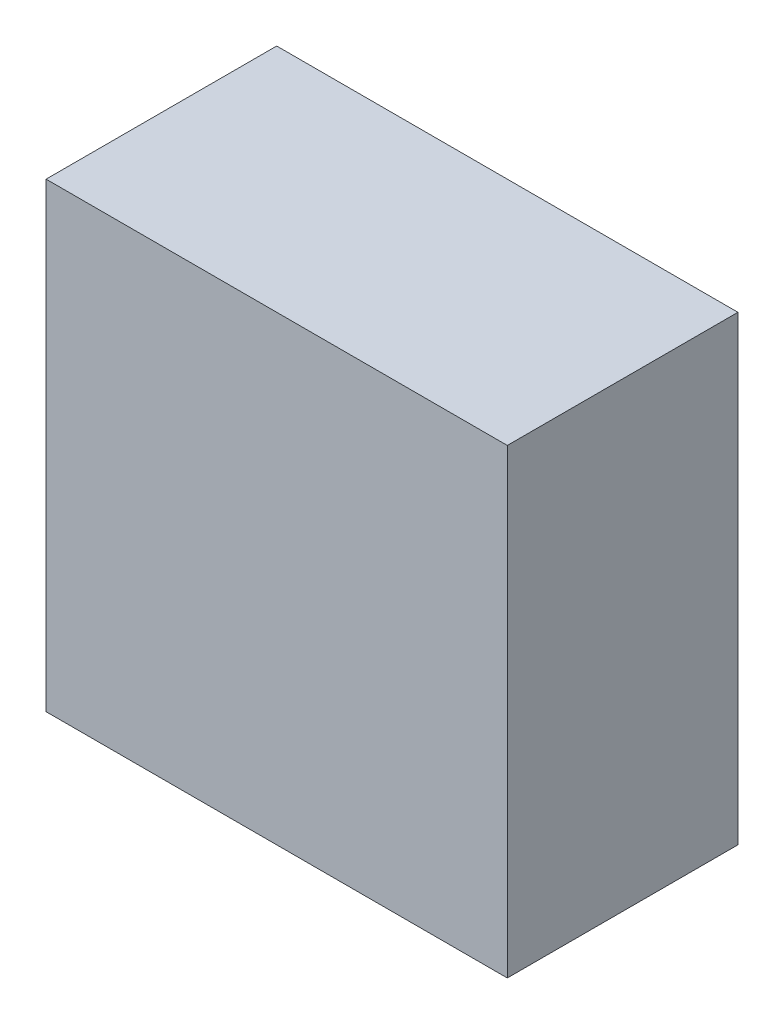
ISO-10303-21;
HEADER;
FILE_DESCRIPTION(('STEP AP214'),'2;1');
FILE_NAME('part.step','',(''),(''),'','','');
FILE_SCHEMA(('AUTOMOTIVE_DESIGN { 1 0 10303 214 1 1 1 1 }'));
ENDSEC;
DATA;
#1=APPLICATION_CONTEXT('core data for automotive mechanical design processes');
#2=APPLICATION_PROTOCOL_DEFINITION('international standard','automotive_design',2000,#1);
#3=PRODUCT_CONTEXT('',#1,'mechanical');
#4=PRODUCT('Part','Part','',(#3));
#5=PRODUCT_RELATED_PRODUCT_CATEGORY('part','',(#4));
#6=PRODUCT_DEFINITION_FORMATION('','',#4);
#7=PRODUCT_DEFINITION_CONTEXT('part definition',#1,'design');
#8=PRODUCT_DEFINITION('design','',#6,#7);
#9=PRODUCT_DEFINITION_SHAPE('','',#8);
#10=(LENGTH_UNIT() NAMED_UNIT(*) SI_UNIT(.MILLI.,.METRE.));
#11=(NAMED_UNIT(*) PLANE_ANGLE_UNIT() SI_UNIT($,.RADIAN.));
#12=(NAMED_UNIT(*) SI_UNIT($,.STERADIAN.) SOLID_ANGLE_UNIT());
#13=UNCERTAINTY_MEASURE_WITH_UNIT(LENGTH_MEASURE(1.E-05),#10,'distance_accuracy_value','');
#14=(GEOMETRIC_REPRESENTATION_CONTEXT(3) GLOBAL_UNCERTAINTY_ASSIGNED_CONTEXT((#13)) GLOBAL_UNIT_ASSIGNED_CONTEXT((#10,
#11,#12)) REPRESENTATION_CONTEXT('',''));
#15=CARTESIAN_POINT('',(0.,0.,0.));
#16=DIRECTION('',(0.,0.,1.));
#17=DIRECTION('',(1.,0.,0.));
#18=AXIS2_PLACEMENT_3D('',#15,#16,#17);
#19=CARTESIAN_POINT('',(-38.1,38.1,19.05));
#20=DIRECTION('',(0.,0.,-1.));
#21=DIRECTION('',(-1.,0.,0.));
#22=AXIS2_PLACEMENT_3D('',#19,#20,#21);
#23=PLANE('',#22);
#24=DIRECTION('',(0.,1.,0.));
#25=VECTOR('',#24,1.);
#26=CARTESIAN_POINT('',(-38.1,-38.1,19.05));
#27=LINE('',#26,#25);
#28=CARTESIAN_POINT('',(-38.1,-38.1,19.05));
#29=VERTEX_POINT('',#28);
#30=CARTESIAN_POINT('',(-38.1,38.1,19.05));
#31=VERTEX_POINT('',#30);
#32=EDGE_CURVE('E19',#29,#31,#27,.T.);
#33=ORIENTED_EDGE('',*,*,#32,.F.);
#34=DIRECTION('',(1.,0.,0.));
#35=VECTOR('',#34,1.);
#36=CARTESIAN_POINT('',(38.1,-38.1,19.05));
#37=LINE('',#36,#35);
#38=CARTESIAN_POINT('',(38.1,-38.1,19.05));
#39=VERTEX_POINT('',#38);
#40=EDGE_CURVE('E78',#39,#29,#37,.F.);
#41=ORIENTED_EDGE('',*,*,#40,.F.);
#42=DIRECTION('',(0.,1.,0.));
#43=VECTOR('',#42,1.);
#44=CARTESIAN_POINT('',(38.1,38.1,19.05));
#45=LINE('',#44,#43);
#46=CARTESIAN_POINT('',(38.1,38.1,19.05));
#47=VERTEX_POINT('',#46);
#48=EDGE_CURVE('E54',#47,#39,#45,.F.);
#49=ORIENTED_EDGE('',*,*,#48,.F.);
#50=DIRECTION('',(1.,0.,0.));
#51=VECTOR('',#50,1.);
#52=CARTESIAN_POINT('',(-38.1,38.1,19.05));
#53=LINE('',#52,#51);
#54=EDGE_CURVE('E56',#31,#47,#53,.T.);
#55=ORIENTED_EDGE('',*,*,#54,.F.);
#56=EDGE_LOOP('',(#33,#41,#49,#55));
#57=FACE_BOUND('',#56,.T.);
#58=ADVANCED_FACE('F16',(#57),#23,.F.);
#59=CARTESIAN_POINT('',(-38.1,-38.1,-19.05));
#60=DIRECTION('',(-1.,0.,0.));
#61=DIRECTION('',(0.,0.,1.));
#62=AXIS2_PLACEMENT_3D('',#59,#60,#61);
#63=PLANE('',#62);
#64=DIRECTION('',(0.,1.,0.));
#65=VECTOR('',#64,1.);
#66=CARTESIAN_POINT('',(-38.1,0.,-19.05));
#67=LINE('',#66,#65);
#68=CARTESIAN_POINT('',(-38.1,-38.1,-19.05));
#69=VERTEX_POINT('',#68);
#70=CARTESIAN_POINT('',(-38.1,38.1,-19.05));
#71=VERTEX_POINT('',#70);
#72=EDGE_CURVE('E82',#69,#71,#67,.T.);
#73=ORIENTED_EDGE('',*,*,#72,.F.);
#74=DIRECTION('',(0.,0.,-1.));
#75=VECTOR('',#74,1.);
#76=CARTESIAN_POINT('',(-38.1,-38.1,-19.05));
#77=LINE('',#76,#75);
#78=EDGE_CURVE('E67',#29,#69,#77,.T.);
#79=ORIENTED_EDGE('',*,*,#78,.F.);
#80=ORIENTED_EDGE('',*,*,#32,.T.);
#81=DIRECTION('',(0.,0.,1.));
#82=VECTOR('',#81,1.);
#83=CARTESIAN_POINT('',(-38.1,38.1,-19.05));
#84=LINE('',#83,#82);
#85=EDGE_CURVE('E62',#71,#31,#84,.T.);
#86=ORIENTED_EDGE('',*,*,#85,.F.);
#87=EDGE_LOOP('',(#73,#79,#80,#86));
#88=FACE_BOUND('',#87,.T.);
#89=ADVANCED_FACE('F64',(#88),#63,.T.);
#90=CARTESIAN_POINT('',(-38.1,38.1,-19.05));
#91=DIRECTION('',(0.,1.,0.));
#92=DIRECTION('',(0.,0.,1.));
#93=AXIS2_PLACEMENT_3D('',#90,#91,#92);
#94=PLANE('',#93);
#95=DIRECTION('',(-1.,0.,0.));
#96=VECTOR('',#95,1.);
#97=CARTESIAN_POINT('',(0.,38.1,-19.05));
#98=LINE('',#97,#96);
#99=CARTESIAN_POINT('',(38.1,38.1,-19.05));
#100=VERTEX_POINT('',#99);
#101=EDGE_CURVE('E71',#71,#100,#98,.F.);
#102=ORIENTED_EDGE('',*,*,#101,.F.);
#103=ORIENTED_EDGE('',*,*,#85,.T.);
#104=ORIENTED_EDGE('',*,*,#54,.T.);
#105=DIRECTION('',(0.,0.,-1.));
#106=VECTOR('',#105,1.);
#107=CARTESIAN_POINT('',(38.1,38.1,-19.05));
#108=LINE('',#107,#106);
#109=EDGE_CURVE('E74',#100,#47,#108,.F.);
#110=ORIENTED_EDGE('',*,*,#109,.F.);
#111=EDGE_LOOP('',(#102,#103,#104,#110));
#112=FACE_BOUND('',#111,.T.);
#113=ADVANCED_FACE('F69',(#112),#94,.T.);
#114=CARTESIAN_POINT('',(38.1,38.1,-19.05));
#115=DIRECTION('',(1.,0.,0.));
#116=DIRECTION('',(0.,0.,-1.));
#117=AXIS2_PLACEMENT_3D('',#114,#115,#116);
#118=PLANE('',#117);
#119=DIRECTION('',(0.,1.,0.));
#120=VECTOR('',#119,1.);
#121=CARTESIAN_POINT('',(38.1,0.,-19.05));
#122=LINE('',#121,#120);
#123=CARTESIAN_POINT('',(38.1,-38.1,-19.05));
#124=VERTEX_POINT('',#123);
#125=EDGE_CURVE('E25',#100,#124,#122,.F.);
#126=ORIENTED_EDGE('',*,*,#125,.F.);
#127=ORIENTED_EDGE('',*,*,#109,.T.);
#128=ORIENTED_EDGE('',*,*,#48,.T.);
#129=DIRECTION('',(0.,0.,-1.));
#130=VECTOR('',#129,1.);
#131=CARTESIAN_POINT('',(38.1,-38.1,-19.05));
#132=LINE('',#131,#130);
#133=EDGE_CURVE('E34',#124,#39,#132,.F.);
#134=ORIENTED_EDGE('',*,*,#133,.F.);
#135=EDGE_LOOP('',(#126,#127,#128,#134));
#136=FACE_BOUND('',#135,.T.);
#137=ADVANCED_FACE('F88',(#136),#118,.T.);
#138=CARTESIAN_POINT('',(38.1,-38.1,-19.05));
#139=DIRECTION('',(0.,-1.,0.));
#140=DIRECTION('',(0.,0.,-1.));
#141=AXIS2_PLACEMENT_3D('',#138,#139,#140);
#142=PLANE('',#141);
#143=DIRECTION('',(-1.,0.,0.));
#144=VECTOR('',#143,1.);
#145=CARTESIAN_POINT('',(0.,-38.1,-19.05));
#146=LINE('',#145,#144);
#147=EDGE_CURVE('E11',#124,#69,#146,.T.);
#148=ORIENTED_EDGE('',*,*,#147,.F.);
#149=ORIENTED_EDGE('',*,*,#133,.T.);
#150=ORIENTED_EDGE('',*,*,#40,.T.);
#151=ORIENTED_EDGE('',*,*,#78,.T.);
#152=EDGE_LOOP('',(#148,#149,#150,#151));
#153=FACE_BOUND('',#152,.T.);
#154=ADVANCED_FACE('F90',(#153),#142,.T.);
#155=CARTESIAN_POINT('',(0.,0.,-19.05));
#156=DIRECTION('',(0.,0.,-1.));
#157=DIRECTION('',(-1.,0.,0.));
#158=AXIS2_PLACEMENT_3D('',#155,#156,#157);
#159=PLANE('',#158);
#160=ORIENTED_EDGE('',*,*,#125,.T.);
#161=ORIENTED_EDGE('',*,*,#147,.T.);
#162=ORIENTED_EDGE('',*,*,#72,.T.);
#163=ORIENTED_EDGE('',*,*,#101,.T.);
#164=EDGE_LOOP('',(#160,#161,#162,#163));
#165=FACE_BOUND('',#164,.T.);
#166=ADVANCED_FACE('F87',(#165),#159,.T.);
#167=CLOSED_SHELL('',(#58,#89,#113,#137,#154,#166));
#168=MANIFOLD_SOLID_BREP('B1',#167);
#169=ADVANCED_BREP_SHAPE_REPRESENTATION('',(#18,#168),#14);
#170=SHAPE_DEFINITION_REPRESENTATION(#9,#169);
ENDSEC;
END-ISO-10303-21;
